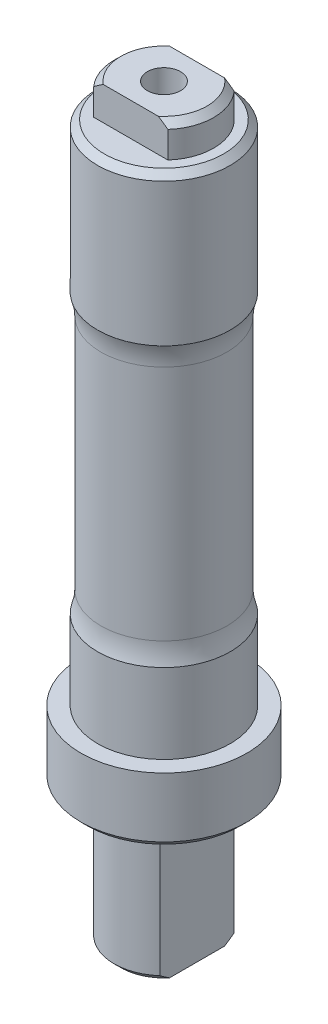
ISO-10303-21;
HEADER;
FILE_DESCRIPTION(('STEP AP214'),'2;1');
FILE_NAME('part.step','',(''),(''),'','','');
FILE_SCHEMA(('AUTOMOTIVE_DESIGN { 1 0 10303 214 1 1 1 1 }'));
ENDSEC;
DATA;
#1=APPLICATION_CONTEXT('core data for automotive mechanical design processes');
#2=APPLICATION_PROTOCOL_DEFINITION('international standard','automotive_design',2000,#1);
#3=PRODUCT_CONTEXT('',#1,'mechanical');
#4=PRODUCT('Part','Part','',(#3));
#5=PRODUCT_RELATED_PRODUCT_CATEGORY('part','',(#4));
#6=PRODUCT_DEFINITION_FORMATION('','',#4);
#7=PRODUCT_DEFINITION_CONTEXT('part definition',#1,'design');
#8=PRODUCT_DEFINITION('design','',#6,#7);
#9=PRODUCT_DEFINITION_SHAPE('','',#8);
#10=(LENGTH_UNIT() NAMED_UNIT(*) SI_UNIT(.MILLI.,.METRE.));
#11=(NAMED_UNIT(*) PLANE_ANGLE_UNIT() SI_UNIT($,.RADIAN.));
#12=(NAMED_UNIT(*) SI_UNIT($,.STERADIAN.) SOLID_ANGLE_UNIT());
#13=UNCERTAINTY_MEASURE_WITH_UNIT(LENGTH_MEASURE(1.E-05),#10,'distance_accuracy_value','');
#14=(GEOMETRIC_REPRESENTATION_CONTEXT(3) GLOBAL_UNCERTAINTY_ASSIGNED_CONTEXT((#13)) GLOBAL_UNIT_ASSIGNED_CONTEXT((#10,
#11,#12)) REPRESENTATION_CONTEXT('',''));
#15=CARTESIAN_POINT('',(0.,0.,0.));
#16=DIRECTION('',(0.,0.,1.));
#17=DIRECTION('',(1.,0.,0.));
#18=AXIS2_PLACEMENT_3D('',#15,#16,#17);
#19=CARTESIAN_POINT('',(0.,38.9818503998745,0.));
#20=DIRECTION('',(0.,1.,0.));
#21=DIRECTION('',(0.,0.,1.));
#22=AXIS2_PLACEMENT_3D('',#19,#20,#21);
#23=CYLINDRICAL_SURFACE('',#22,7.50000000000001);
#24=DIRECTION('',(0.,1.,0.));
#25=VECTOR('',#24,1.);
#26=CARTESIAN_POINT('',(-5.,38.9818503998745,5.59016994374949));
#27=LINE('',#26,#25);
#28=CARTESIAN_POINT('',(-5.,-80.5144266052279,5.59016994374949));
#29=VERTEX_POINT('',#28);
#30=CARTESIAN_POINT('',(-5.,-60.5144266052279,5.59016994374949));
#31=VERTEX_POINT('',#30);
#32=EDGE_CURVE('E164',#29,#31,#27,.T.);
#33=ORIENTED_EDGE('',*,*,#32,.F.);
#34=CARTESIAN_POINT('',(0.,-80.5144266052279,0.));
#35=DIRECTION('',(0.,1.,0.));
#36=DIRECTION('',(0.,0.,1.));
#37=AXIS2_PLACEMENT_3D('',#34,#35,#36);
#38=CIRCLE('',#37,7.50000000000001);
#39=CARTESIAN_POINT('',(5.,-80.5144266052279,5.59016994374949));
#40=VERTEX_POINT('',#39);
#41=EDGE_CURVE('E404',#29,#40,#38,.T.);
#42=ORIENTED_EDGE('',*,*,#41,.T.);
#43=DIRECTION('',(0.,1.,0.));
#44=VECTOR('',#43,1.);
#45=CARTESIAN_POINT('',(5.,38.9818503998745,5.59016994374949));
#46=LINE('',#45,#44);
#47=CARTESIAN_POINT('',(5.,-60.5144266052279,5.59016994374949));
#48=VERTEX_POINT('',#47);
#49=EDGE_CURVE('E156',#48,#40,#46,.F.);
#50=ORIENTED_EDGE('',*,*,#49,.F.);
#51=CARTESIAN_POINT('',(0.,-60.5144266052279,0.));
#52=DIRECTION('',(0.,1.,0.));
#53=DIRECTION('',(0.,0.,1.));
#54=AXIS2_PLACEMENT_3D('',#51,#52,#53);
#55=CIRCLE('',#54,7.50000000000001);
#56=EDGE_CURVE('E185',#31,#48,#55,.T.);
#57=ORIENTED_EDGE('',*,*,#56,.F.);
#58=EDGE_LOOP('',(#33,#42,#50,#57));
#59=FACE_BOUND('',#58,.T.);
#60=ADVANCED_FACE('F36',(#59),#23,.T.);
#61=DIRECTION('',(0.,1.,0.));
#62=VECTOR('',#61,1.);
#63=CARTESIAN_POINT('',(5.,38.9818503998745,-5.59016994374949));
#64=LINE('',#63,#62);
#65=CARTESIAN_POINT('',(5.,-80.5144266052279,-5.59016994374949));
#66=VERTEX_POINT('',#65);
#67=CARTESIAN_POINT('',(5.,-60.5144266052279,-5.59016994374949));
#68=VERTEX_POINT('',#67);
#69=EDGE_CURVE('E159',#66,#68,#64,.T.);
#70=ORIENTED_EDGE('',*,*,#69,.F.);
#71=CARTESIAN_POINT('',(0.,-80.5144266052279,0.));
#72=DIRECTION('',(0.,1.,0.));
#73=DIRECTION('',(0.,0.,1.));
#74=AXIS2_PLACEMENT_3D('',#71,#72,#73);
#75=CIRCLE('',#74,7.50000000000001);
#76=CARTESIAN_POINT('',(-5.,-80.5144266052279,-5.59016994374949));
#77=VERTEX_POINT('',#76);
#78=EDGE_CURVE('E217',#66,#77,#75,.T.);
#79=ORIENTED_EDGE('',*,*,#78,.T.);
#80=DIRECTION('',(0.,1.,0.));
#81=VECTOR('',#80,1.);
#82=CARTESIAN_POINT('',(-5.,38.9818503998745,-5.59016994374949));
#83=LINE('',#82,#81);
#84=CARTESIAN_POINT('',(-5.,-60.5144266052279,-5.59016994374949));
#85=VERTEX_POINT('',#84);
#86=EDGE_CURVE('E161',#85,#77,#83,.F.);
#87=ORIENTED_EDGE('',*,*,#86,.F.);
#88=EDGE_CURVE('E188',#68,#85,#55,.T.);
#89=ORIENTED_EDGE('',*,*,#88,.F.);
#90=EDGE_LOOP('',(#70,#79,#87,#89));
#91=FACE_BOUND('',#90,.T.);
#92=ADVANCED_FACE('F280',(#91),#23,.T.);
#93=CARTESIAN_POINT('',(0.,-81.5144266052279,-7.50000000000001));
#94=DIRECTION('',(0.,1.,0.));
#95=DIRECTION('',(0.,0.,1.));
#96=AXIS2_PLACEMENT_3D('',#93,#94,#95);
#97=PLANE('',#96);
#98=CARTESIAN_POINT('',(0.,-81.5144266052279,0.));
#99=DIRECTION('',(0.,-1.,0.));
#100=DIRECTION('',(0.,0.,-1.));
#101=AXIS2_PLACEMENT_3D('',#98,#99,#100);
#102=CIRCLE('',#101,2.49999999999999);
#103=CARTESIAN_POINT('',(0.,-81.5144266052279,-2.49999999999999));
#104=VERTEX_POINT('',#103);
#105=EDGE_CURVE('E141',#104,#104,#102,.T.);
#106=ORIENTED_EDGE('',*,*,#105,.F.);
#107=EDGE_LOOP('',(#106));
#108=FACE_BOUND('',#107,.T.);
#109=DIRECTION('',(0.,0.,1.));
#110=VECTOR('',#109,1.);
#111=CARTESIAN_POINT('',(-5.,-81.5144266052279,-7.50000000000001));
#112=LINE('',#111,#110);
#113=CARTESIAN_POINT('',(-5.,-81.5144266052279,-4.15331193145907));
#114=VERTEX_POINT('',#113);
#115=CARTESIAN_POINT('',(-5.,-81.5144266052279,4.15331193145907));
#116=VERTEX_POINT('',#115);
#117=EDGE_CURVE('E208',#114,#116,#112,.T.);
#118=ORIENTED_EDGE('',*,*,#117,.F.);
#119=CARTESIAN_POINT('',(0.,-81.5144266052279,0.));
#120=DIRECTION('',(0.,1.,0.));
#121=DIRECTION('',(0.,0.,1.));
#122=AXIS2_PLACEMENT_3D('',#119,#120,#121);
#123=CIRCLE('',#122,6.50000000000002);
#124=CARTESIAN_POINT('',(5.,-81.5144266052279,-4.15331193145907));
#125=VERTEX_POINT('',#124);
#126=EDGE_CURVE('E256',#114,#125,#123,.F.);
#127=ORIENTED_EDGE('',*,*,#126,.T.);
#128=DIRECTION('',(0.,0.,-1.));
#129=VECTOR('',#128,1.);
#130=CARTESIAN_POINT('',(5.,-81.5144266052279,-7.50000000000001));
#131=LINE('',#130,#129);
#132=CARTESIAN_POINT('',(5.,-81.5144266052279,4.15331193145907));
#133=VERTEX_POINT('',#132);
#134=EDGE_CURVE('E205',#133,#125,#131,.T.);
#135=ORIENTED_EDGE('',*,*,#134,.F.);
#136=CARTESIAN_POINT('',(0.,-81.5144266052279,0.));
#137=DIRECTION('',(0.,1.,0.));
#138=DIRECTION('',(0.,0.,1.));
#139=AXIS2_PLACEMENT_3D('',#136,#137,#138);
#140=CIRCLE('',#139,6.50000000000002);
#141=EDGE_CURVE('E418',#133,#116,#140,.F.);
#142=ORIENTED_EDGE('',*,*,#141,.T.);
#143=EDGE_LOOP('',(#118,#127,#135,#142));
#144=FACE_BOUND('',#143,.T.);
#145=ADVANCED_FACE('F286',(#108,#144),#97,.F.);
#146=CARTESIAN_POINT('',(0.,30.9855733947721,0.));
#147=DIRECTION('',(0.,-1.,0.));
#148=DIRECTION('',(0.,0.,-1.));
#149=AXIS2_PLACEMENT_3D('',#146,#147,#148);
#150=PLANE('',#149);
#151=CARTESIAN_POINT('',(0.,30.9855733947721,0.));
#152=DIRECTION('',(0.,1.,0.));
#153=DIRECTION('',(0.,0.,1.));
#154=AXIS2_PLACEMENT_3D('',#151,#152,#153);
#155=CIRCLE('',#154,2.49999999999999);
#156=CARTESIAN_POINT('',(0.,30.9855733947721,2.49999999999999));
#157=VERTEX_POINT('',#156);
#158=EDGE_CURVE('E142',#157,#157,#155,.T.);
#159=ORIENTED_EDGE('',*,*,#158,.F.);
#160=EDGE_LOOP('',(#159));
#161=FACE_BOUND('',#160,.T.);
#162=DIRECTION('',(1.,0.,0.));
#163=VECTOR('',#162,1.);
#164=CARTESIAN_POINT('',(-7.89285647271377,30.9855733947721,5.));
#165=LINE('',#164,#163);
#166=CARTESIAN_POINT('',(-4.15331193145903,30.9855733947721,5.));
#167=VERTEX_POINT('',#166);
#168=CARTESIAN_POINT('',(4.15331193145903,30.9855733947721,5.));
#169=VERTEX_POINT('',#168);
#170=EDGE_CURVE('E170',#167,#169,#165,.T.);
#171=ORIENTED_EDGE('',*,*,#170,.T.);
#172=CARTESIAN_POINT('',(0.,30.9855733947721,0.));
#173=DIRECTION('',(0.,-1.,0.));
#174=DIRECTION('',(0.,0.,-1.));
#175=AXIS2_PLACEMENT_3D('',#172,#173,#174);
#176=CIRCLE('',#175,6.49999999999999);
#177=CARTESIAN_POINT('',(4.15331193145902,30.9855733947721,-5.));
#178=VERTEX_POINT('',#177);
#179=EDGE_CURVE('E352',#169,#178,#176,.F.);
#180=ORIENTED_EDGE('',*,*,#179,.T.);
#181=DIRECTION('',(-1.,0.,0.));
#182=VECTOR('',#181,1.);
#183=CARTESIAN_POINT('',(-7.89285647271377,30.9855733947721,-5.));
#184=LINE('',#183,#182);
#185=CARTESIAN_POINT('',(-4.15331193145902,30.9855733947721,-5.));
#186=VERTEX_POINT('',#185);
#187=EDGE_CURVE('E166',#178,#186,#184,.T.);
#188=ORIENTED_EDGE('',*,*,#187,.T.);
#189=CARTESIAN_POINT('',(0.,30.9855733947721,0.));
#190=DIRECTION('',(0.,-1.,0.));
#191=DIRECTION('',(0.,0.,-1.));
#192=AXIS2_PLACEMENT_3D('',#189,#190,#191);
#193=CIRCLE('',#192,6.49999999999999);
#194=EDGE_CURVE('E394',#186,#167,#193,.F.);
#195=ORIENTED_EDGE('',*,*,#194,.T.);
#196=EDGE_LOOP('',(#171,#180,#188,#195));
#197=FACE_BOUND('',#196,.T.);
#198=ADVANCED_FACE('F325',(#161,#197),#150,.F.);
#199=CARTESIAN_POINT('',(0.,38.9818503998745,0.));
#200=DIRECTION('',(0.,1.,0.));
#201=DIRECTION('',(0.,0.,1.));
#202=AXIS2_PLACEMENT_3D('',#199,#200,#201);
#203=CYLINDRICAL_SURFACE('',#202,7.5);
#204=DIRECTION('',(0.,1.,0.));
#205=VECTOR('',#204,1.);
#206=CARTESIAN_POINT('',(5.59016994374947,38.9818503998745,-5.));
#207=LINE('',#206,#205);
#208=CARTESIAN_POINT('',(5.59016994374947,29.9855733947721,-5.));
#209=VERTEX_POINT('',#208);
#210=CARTESIAN_POINT('',(5.59016994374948,25.9855733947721,-5.));
#211=VERTEX_POINT('',#210);
#212=EDGE_CURVE('E172',#209,#211,#207,.F.);
#213=ORIENTED_EDGE('',*,*,#212,.F.);
#214=CARTESIAN_POINT('',(0.,29.9855733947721,0.));
#215=DIRECTION('',(0.,-1.,0.));
#216=DIRECTION('',(0.,0.,-1.));
#217=AXIS2_PLACEMENT_3D('',#214,#215,#216);
#218=CIRCLE('',#217,7.5);
#219=CARTESIAN_POINT('',(5.59016994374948,29.9855733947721,5.));
#220=VERTEX_POINT('',#219);
#221=EDGE_CURVE('E59',#209,#220,#218,.T.);
#222=ORIENTED_EDGE('',*,*,#221,.T.);
#223=DIRECTION('',(0.,1.,0.));
#224=VECTOR('',#223,1.);
#225=CARTESIAN_POINT('',(5.59016994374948,38.9818503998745,5.));
#226=LINE('',#225,#224);
#227=CARTESIAN_POINT('',(5.59016994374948,25.9855733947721,5.));
#228=VERTEX_POINT('',#227);
#229=EDGE_CURVE('E183',#228,#220,#226,.T.);
#230=ORIENTED_EDGE('',*,*,#229,.F.);
#231=CARTESIAN_POINT('',(0.,25.9855733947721,0.));
#232=DIRECTION('',(0.,1.,0.));
#233=DIRECTION('',(0.,0.,1.));
#234=AXIS2_PLACEMENT_3D('',#231,#232,#233);
#235=CIRCLE('',#234,7.5);
#236=EDGE_CURVE('E202',#228,#211,#235,.T.);
#237=ORIENTED_EDGE('',*,*,#236,.T.);
#238=EDGE_LOOP('',(#213,#222,#230,#237));
#239=FACE_BOUND('',#238,.T.);
#240=ADVANCED_FACE('F322',(#239),#203,.T.);
#241=DIRECTION('',(0.,1.,0.));
#242=VECTOR('',#241,1.);
#243=CARTESIAN_POINT('',(-5.59016994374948,38.9818503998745,5.));
#244=LINE('',#243,#242);
#245=CARTESIAN_POINT('',(-5.59016994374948,29.9855733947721,5.));
#246=VERTEX_POINT('',#245);
#247=CARTESIAN_POINT('',(-5.59016994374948,25.9855733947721,5.));
#248=VERTEX_POINT('',#247);
#249=EDGE_CURVE('E181',#246,#248,#244,.F.);
#250=ORIENTED_EDGE('',*,*,#249,.F.);
#251=CARTESIAN_POINT('',(0.,29.9855733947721,0.));
#252=DIRECTION('',(0.,-1.,0.));
#253=DIRECTION('',(0.,0.,-1.));
#254=AXIS2_PLACEMENT_3D('',#251,#252,#253);
#255=CIRCLE('',#254,7.5);
#256=CARTESIAN_POINT('',(-5.59016994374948,29.9855733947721,-5.));
#257=VERTEX_POINT('',#256);
#258=EDGE_CURVE('E353',#246,#257,#255,.T.);
#259=ORIENTED_EDGE('',*,*,#258,.T.);
#260=DIRECTION('',(0.,1.,0.));
#261=VECTOR('',#260,1.);
#262=CARTESIAN_POINT('',(-5.59016994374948,38.9818503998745,-5.));
#263=LINE('',#262,#261);
#264=CARTESIAN_POINT('',(-5.59016994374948,25.9855733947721,-5.));
#265=VERTEX_POINT('',#264);
#266=EDGE_CURVE('E178',#265,#257,#263,.T.);
#267=ORIENTED_EDGE('',*,*,#266,.F.);
#268=EDGE_CURVE('E201',#265,#248,#235,.T.);
#269=ORIENTED_EDGE('',*,*,#268,.T.);
#270=EDGE_LOOP('',(#250,#259,#267,#269));
#271=FACE_BOUND('',#270,.T.);
#272=ADVANCED_FACE('F320',(#271),#203,.T.);
#273=CARTESIAN_POINT('',(0.,25.9855733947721,-7.5));
#274=DIRECTION('',(0.,-1.,0.));
#275=DIRECTION('',(0.,0.,-1.));
#276=AXIS2_PLACEMENT_3D('',#273,#274,#275);
#277=PLANE('',#276);
#278=CARTESIAN_POINT('',(0.,25.9855733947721,0.));
#279=DIRECTION('',(0.,-1.,0.));
#280=DIRECTION('',(0.,0.,-1.));
#281=AXIS2_PLACEMENT_3D('',#278,#279,#280);
#282=CIRCLE('',#281,8.99999999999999);
#283=CARTESIAN_POINT('',(0.,25.9855733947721,-8.99999999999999));
#284=VERTEX_POINT('',#283);
#285=EDGE_CURVE('E211',#284,#284,#282,.F.);
#286=ORIENTED_EDGE('',*,*,#285,.T.);
#287=EDGE_LOOP('',(#286));
#288=FACE_BOUND('',#287,.T.);
#289=ORIENTED_EDGE('',*,*,#236,.F.);
#290=DIRECTION('',(1.,0.,0.));
#291=VECTOR('',#290,1.);
#292=CARTESIAN_POINT('',(-7.89285647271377,25.9855733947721,5.));
#293=LINE('',#292,#291);
#294=EDGE_CURVE('E169',#248,#228,#293,.T.);
#295=ORIENTED_EDGE('',*,*,#294,.F.);
#296=ORIENTED_EDGE('',*,*,#268,.F.);
#297=DIRECTION('',(-1.,0.,0.));
#298=VECTOR('',#297,1.);
#299=CARTESIAN_POINT('',(-7.89285647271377,25.9855733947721,-5.));
#300=LINE('',#299,#298);
#301=EDGE_CURVE('E167',#211,#265,#300,.T.);
#302=ORIENTED_EDGE('',*,*,#301,.F.);
#303=EDGE_LOOP('',(#289,#295,#296,#302));
#304=FACE_BOUND('',#303,.T.);
#305=ADVANCED_FACE('F316',(#288,#304),#277,.F.);
#306=CARTESIAN_POINT('',(0.,38.9818503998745,0.));
#307=DIRECTION('',(0.,1.,0.));
#308=DIRECTION('',(0.,0.,1.));
#309=AXIS2_PLACEMENT_3D('',#306,#307,#308);
#310=CYLINDRICAL_SURFACE('',#309,10.);
#311=CARTESIAN_POINT('',(0.,24.9855733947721,0.));
#312=DIRECTION('',(0.,-1.,0.));
#313=DIRECTION('',(0.,0.,-1.));
#314=AXIS2_PLACEMENT_3D('',#311,#312,#313);
#315=CIRCLE('',#314,10.);
#316=CARTESIAN_POINT('',(0.,24.9855733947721,-10.));
#317=VERTEX_POINT('',#316);
#318=EDGE_CURVE('E214',#317,#317,#315,.T.);
#319=ORIENTED_EDGE('',*,*,#318,.T.);
#320=EDGE_LOOP('',(#319));
#321=FACE_BOUND('',#320,.T.);
#322=CARTESIAN_POINT('',(0.,3.48557339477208,0.));
#323=DIRECTION('',(0.,1.,0.));
#324=DIRECTION('',(0.,0.,1.));
#325=AXIS2_PLACEMENT_3D('',#322,#323,#324);
#326=CIRCLE('',#325,10.);
#327=CARTESIAN_POINT('',(0.,3.48557339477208,10.));
#328=VERTEX_POINT('',#327);
#329=EDGE_CURVE('E198',#328,#328,#326,.T.);
#330=ORIENTED_EDGE('',*,*,#329,.T.);
#331=EDGE_LOOP('',(#330));
#332=FACE_BOUND('',#331,.T.);
#333=ADVANCED_FACE('F312',(#321,#332),#310,.T.);
#334=CARTESIAN_POINT('',(0.,38.9818503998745,0.));
#335=DIRECTION('',(0.,1.,0.));
#336=DIRECTION('',(0.,0.,1.));
#337=AXIS2_PLACEMENT_3D('',#334,#335,#336);
#338=CYLINDRICAL_SURFACE('',#337,9.5);
#339=CARTESIAN_POINT('',(0.,-35.3919276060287,0.));
#340=DIRECTION('',(0.,-1.,0.));
#341=DIRECTION('',(0.,0.,-1.));
#342=AXIS2_PLACEMENT_3D('',#339,#340,#341);
#343=CIRCLE('',#342,9.5);
#344=CARTESIAN_POINT('',(0.,-35.3919276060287,-9.5));
#345=VERTEX_POINT('',#344);
#346=EDGE_CURVE('E12',#345,#345,#343,.F.);
#347=ORIENTED_EDGE('',*,*,#346,.T.);
#348=EDGE_LOOP('',(#347));
#349=FACE_BOUND('',#348,.T.);
#350=CARTESIAN_POINT('',(0.,0.363074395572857,0.));
#351=DIRECTION('',(0.,1.,0.));
#352=DIRECTION('',(0.,0.,1.));
#353=AXIS2_PLACEMENT_3D('',#350,#351,#352);
#354=CIRCLE('',#353,9.5);
#355=CARTESIAN_POINT('',(0.,0.363074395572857,9.5));
#356=VERTEX_POINT('',#355);
#357=EDGE_CURVE('E44',#356,#356,#354,.F.);
#358=ORIENTED_EDGE('',*,*,#357,.T.);
#359=EDGE_LOOP('',(#358));
#360=FACE_BOUND('',#359,.T.);
#361=ADVANCED_FACE('F308',(#349,#360),#338,.T.);
#362=CARTESIAN_POINT('',(0.,38.9818503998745,0.));
#363=DIRECTION('',(0.,1.,0.));
#364=DIRECTION('',(0.,0.,1.));
#365=AXIS2_PLACEMENT_3D('',#362,#363,#364);
#366=CYLINDRICAL_SURFACE('',#365,10.);
#367=CARTESIAN_POINT('',(0.,-38.5144266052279,0.));
#368=DIRECTION('',(0.,1.,0.));
#369=DIRECTION('',(0.,0.,1.));
#370=AXIS2_PLACEMENT_3D('',#367,#368,#369);
#371=CIRCLE('',#370,10.);
#372=CARTESIAN_POINT('',(0.,-38.5144266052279,10.));
#373=VERTEX_POINT('',#372);
#374=EDGE_CURVE('E195',#373,#373,#371,.T.);
#375=ORIENTED_EDGE('',*,*,#374,.F.);
#376=EDGE_LOOP('',(#375));
#377=FACE_BOUND('',#376,.T.);
#378=CARTESIAN_POINT('',(0.,-50.5144266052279,0.));
#379=DIRECTION('',(0.,1.,0.));
#380=DIRECTION('',(0.,0.,1.));
#381=AXIS2_PLACEMENT_3D('',#378,#379,#380);
#382=CIRCLE('',#381,10.);
#383=CARTESIAN_POINT('',(0.,-50.5144266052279,10.));
#384=VERTEX_POINT('',#383);
#385=EDGE_CURVE('E192',#384,#384,#382,.T.);
#386=ORIENTED_EDGE('',*,*,#385,.T.);
#387=EDGE_LOOP('',(#386));
#388=FACE_BOUND('',#387,.T.);
#389=ADVANCED_FACE('F304',(#377,#388),#366,.T.);
#390=CARTESIAN_POINT('',(0.,-50.5144266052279,-10.));
#391=DIRECTION('',(0.,-1.,0.));
#392=DIRECTION('',(0.,0.,-1.));
#393=AXIS2_PLACEMENT_3D('',#390,#391,#392);
#394=PLANE('',#393);
#395=ORIENTED_EDGE('',*,*,#385,.F.);
#396=EDGE_LOOP('',(#395));
#397=FACE_BOUND('',#396,.T.);
#398=CARTESIAN_POINT('',(0.,-50.5144266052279,0.));
#399=DIRECTION('',(0.,1.,0.));
#400=DIRECTION('',(0.,0.,1.));
#401=AXIS2_PLACEMENT_3D('',#398,#399,#400);
#402=CIRCLE('',#401,12.5);
#403=CARTESIAN_POINT('',(0.,-50.5144266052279,12.5));
#404=VERTEX_POINT('',#403);
#405=EDGE_CURVE('E189',#404,#404,#402,.T.);
#406=ORIENTED_EDGE('',*,*,#405,.T.);
#407=EDGE_LOOP('',(#406));
#408=FACE_BOUND('',#407,.T.);
#409=ADVANCED_FACE('F300',(#397,#408),#394,.F.);
#410=CARTESIAN_POINT('',(0.,38.9818503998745,0.));
#411=DIRECTION('',(0.,1.,0.));
#412=DIRECTION('',(0.,0.,1.));
#413=AXIS2_PLACEMENT_3D('',#410,#411,#412);
#414=CYLINDRICAL_SURFACE('',#413,12.5);
#415=CARTESIAN_POINT('',(0.,-59.5144266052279,0.));
#416=DIRECTION('',(0.,1.,0.));
#417=DIRECTION('',(0.,0.,1.));
#418=AXIS2_PLACEMENT_3D('',#415,#416,#417);
#419=CIRCLE('',#418,12.5);
#420=CARTESIAN_POINT('',(0.,-59.5144266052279,12.5));
#421=VERTEX_POINT('',#420);
#422=EDGE_CURVE('E400',#421,#421,#419,.T.);
#423=ORIENTED_EDGE('',*,*,#422,.T.);
#424=EDGE_LOOP('',(#423));
#425=FACE_BOUND('',#424,.T.);
#426=ORIENTED_EDGE('',*,*,#405,.F.);
#427=EDGE_LOOP('',(#426));
#428=FACE_BOUND('',#427,.T.);
#429=ADVANCED_FACE('F296',(#425,#428),#414,.T.);
#430=CARTESIAN_POINT('',(0.,-60.5144266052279,-12.5));
#431=DIRECTION('',(0.,1.,0.));
#432=DIRECTION('',(0.,0.,1.));
#433=AXIS2_PLACEMENT_3D('',#430,#431,#432);
#434=PLANE('',#433);
#435=CARTESIAN_POINT('',(0.,-60.5144266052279,0.));
#436=DIRECTION('',(0.,1.,0.));
#437=DIRECTION('',(0.,0.,1.));
#438=AXIS2_PLACEMENT_3D('',#435,#436,#437);
#439=CIRCLE('',#438,11.5);
#440=CARTESIAN_POINT('',(0.,-60.5144266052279,11.5));
#441=VERTEX_POINT('',#440);
#442=EDGE_CURVE('E397',#441,#441,#439,.F.);
#443=ORIENTED_EDGE('',*,*,#442,.T.);
#444=EDGE_LOOP('',(#443));
#445=FACE_BOUND('',#444,.T.);
#446=ORIENTED_EDGE('',*,*,#88,.T.);
#447=DIRECTION('',(0.,0.,-1.));
#448=VECTOR('',#447,1.);
#449=CARTESIAN_POINT('',(-5.,-60.5144266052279,-7.84463128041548));
#450=LINE('',#449,#448);
#451=EDGE_CURVE('E152',#31,#85,#450,.T.);
#452=ORIENTED_EDGE('',*,*,#451,.F.);
#453=ORIENTED_EDGE('',*,*,#56,.T.);
#454=DIRECTION('',(0.,0.,1.));
#455=VECTOR('',#454,1.);
#456=CARTESIAN_POINT('',(5.,-60.5144266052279,-7.84463128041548));
#457=LINE('',#456,#455);
#458=EDGE_CURVE('E154',#68,#48,#457,.T.);
#459=ORIENTED_EDGE('',*,*,#458,.F.);
#460=EDGE_LOOP('',(#446,#452,#453,#459));
#461=FACE_BOUND('',#460,.T.);
#462=ADVANCED_FACE('F292',(#445,#461),#434,.F.);
#463=CARTESIAN_POINT('',(-7.89285647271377,25.9855733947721,-5.));
#464=DIRECTION('',(0.,0.,-1.));
#465=DIRECTION('',(-1.,0.,0.));
#466=AXIS2_PLACEMENT_3D('',#463,#464,#465);
#467=PLANE('',#466);
#468=ORIENTED_EDGE('',*,*,#187,.F.);
#469=CARTESIAN_POINT('',(4.15331193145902,30.9855733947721,-5.));
#470=CARTESIAN_POINT('',(4.2762895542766,30.9069776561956,-5.));
#471=CARTESIAN_POINT('',(4.39833700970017,30.8269445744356,-5.));
#472=CARTESIAN_POINT('',(4.64072592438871,30.664415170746,-5.));
#473=CARTESIAN_POINT('',(4.76106791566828,30.5819196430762,-5.));
#474=CARTESIAN_POINT('',(5.00027029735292,30.4148318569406,-5.));
#475=CARTESIAN_POINT('',(5.11913078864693,30.3302397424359,-5.));
#476=CARTESIAN_POINT('',(5.35557663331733,30.1592118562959,-5.));
#477=CARTESIAN_POINT('',(5.47316156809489,30.072775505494,-5.));
#478=CARTESIAN_POINT('',(5.59016994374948,29.9855733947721,-5.));
#479=B_SPLINE_CURVE_WITH_KNOTS('',3,(#469,#470,#471,#472,#473,#474,#475,#476,#477,#478),
.UNSPECIFIED.,.F.,.F.,(4,2,2,2,4),(0.,0.43781964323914,0.87549956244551,1.31314951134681,
1.75093898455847),.UNSPECIFIED.);
#480=EDGE_CURVE('E372',#178,#209,#479,.T.);
#481=ORIENTED_EDGE('',*,*,#480,.T.);
#482=ORIENTED_EDGE('',*,*,#212,.T.);
#483=ORIENTED_EDGE('',*,*,#301,.T.);
#484=ORIENTED_EDGE('',*,*,#266,.T.);
#485=CARTESIAN_POINT('',(-5.59016994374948,29.9855733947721,-5.));
#486=CARTESIAN_POINT('',(-5.47316156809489,30.072775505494,-5.));
#487=CARTESIAN_POINT('',(-5.35557663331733,30.1592118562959,-5.));
#488=CARTESIAN_POINT('',(-5.11913078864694,30.3302397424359,-5.));
#489=CARTESIAN_POINT('',(-5.00027029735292,30.4148318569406,-5.));
#490=CARTESIAN_POINT('',(-4.76106791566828,30.5819196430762,-5.));
#491=CARTESIAN_POINT('',(-4.64072592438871,30.664415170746,-5.));
#492=CARTESIAN_POINT('',(-4.39833700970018,30.8269445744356,-5.));
#493=CARTESIAN_POINT('',(-4.2762895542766,30.9069776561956,-5.));
#494=CARTESIAN_POINT('',(-4.15331193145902,30.9855733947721,-5.));
#495=B_SPLINE_CURVE_WITH_KNOTS('',3,(#485,#486,#487,#488,#489,#490,#491,#492,#493,#494),
.UNSPECIFIED.,.F.,.F.,(4,2,2,2,4),(0.,0.437789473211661,0.875439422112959,1.31311934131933,
1.75093898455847),.UNSPECIFIED.);
#496=EDGE_CURVE('E377',#257,#186,#495,.T.);
#497=ORIENTED_EDGE('',*,*,#496,.T.);
#498=EDGE_LOOP('',(#468,#481,#482,#483,#484,#497));
#499=FACE_BOUND('',#498,.T.);
#500=ADVANCED_FACE('F295',(#499),#467,.T.);
#501=CARTESIAN_POINT('',(-7.89285647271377,25.9855733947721,5.));
#502=DIRECTION('',(0.,0.,1.));
#503=DIRECTION('',(1.,0.,0.));
#504=AXIS2_PLACEMENT_3D('',#501,#502,#503);
#505=PLANE('',#504);
#506=ORIENTED_EDGE('',*,*,#229,.T.);
#507=CARTESIAN_POINT('',(5.59016994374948,29.9855733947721,5.));
#508=CARTESIAN_POINT('',(5.47316156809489,30.072775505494,5.));
#509=CARTESIAN_POINT('',(5.35557663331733,30.1592118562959,5.));
#510=CARTESIAN_POINT('',(5.11913078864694,30.3302397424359,5.));
#511=CARTESIAN_POINT('',(5.00027029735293,30.4148318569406,5.));
#512=CARTESIAN_POINT('',(4.76106791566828,30.5819196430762,5.));
#513=CARTESIAN_POINT('',(4.64072592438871,30.664415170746,5.));
#514=CARTESIAN_POINT('',(4.39833700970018,30.8269445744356,5.));
#515=CARTESIAN_POINT('',(4.2762895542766,30.9069776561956,5.));
#516=CARTESIAN_POINT('',(4.15331193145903,30.9855733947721,5.));
#517=B_SPLINE_CURVE_WITH_KNOTS('',3,(#507,#508,#509,#510,#511,#512,#513,#514,#515,#516),
.UNSPECIFIED.,.F.,.F.,(4,2,2,2,4),(0.,0.437789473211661,0.875439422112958,1.31311934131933,
1.75093898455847),.UNSPECIFIED.);
#518=EDGE_CURVE('E347',#220,#169,#517,.T.);
#519=ORIENTED_EDGE('',*,*,#518,.T.);
#520=ORIENTED_EDGE('',*,*,#170,.F.);
#521=CARTESIAN_POINT('',(-4.15331193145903,30.9855733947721,5.));
#522=CARTESIAN_POINT('',(-4.2762895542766,30.9069776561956,5.));
#523=CARTESIAN_POINT('',(-4.39833700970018,30.8269445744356,5.));
#524=CARTESIAN_POINT('',(-4.64072592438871,30.664415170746,5.));
#525=CARTESIAN_POINT('',(-4.76106791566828,30.5819196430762,5.));
#526=CARTESIAN_POINT('',(-5.00027029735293,30.4148318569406,5.));
#527=CARTESIAN_POINT('',(-5.11913078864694,30.3302397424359,5.));
#528=CARTESIAN_POINT('',(-5.35557663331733,30.1592118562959,5.));
#529=CARTESIAN_POINT('',(-5.47316156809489,30.072775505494,5.));
#530=CARTESIAN_POINT('',(-5.59016994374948,29.9855733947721,5.));
#531=B_SPLINE_CURVE_WITH_KNOTS('',3,(#521,#522,#523,#524,#525,#526,#527,#528,#529,#530),
.UNSPECIFIED.,.F.,.F.,(4,2,2,2,4),(0.,0.43781964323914,0.87549956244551,1.31314951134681,
1.75093898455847),.UNSPECIFIED.);
#532=EDGE_CURVE('E51',#167,#246,#531,.T.);
#533=ORIENTED_EDGE('',*,*,#532,.T.);
#534=ORIENTED_EDGE('',*,*,#249,.T.);
#535=ORIENTED_EDGE('',*,*,#294,.T.);
#536=EDGE_LOOP('',(#506,#519,#520,#533,#534,#535));
#537=FACE_BOUND('',#536,.T.);
#538=ADVANCED_FACE('F265',(#537),#505,.T.);
#539=CARTESIAN_POINT('',(5.,-60.5144266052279,-7.84463128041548));
#540=DIRECTION('',(1.,0.,0.));
#541=DIRECTION('',(0.,0.,-1.));
#542=AXIS2_PLACEMENT_3D('',#539,#540,#541);
#543=PLANE('',#542);
#544=ORIENTED_EDGE('',*,*,#134,.T.);
#545=CARTESIAN_POINT('',(5.,-81.5144266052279,-4.15331193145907));
#546=CARTESIAN_POINT('',(5.,-81.4358308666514,-4.27628955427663));
#547=CARTESIAN_POINT('',(5.,-81.3557977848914,-4.39833700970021));
#548=CARTESIAN_POINT('',(5.,-81.1932683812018,-4.64072592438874));
#549=CARTESIAN_POINT('',(5.,-81.1107728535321,-4.76106791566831));
#550=CARTESIAN_POINT('',(5.,-80.9436850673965,-5.00027029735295));
#551=CARTESIAN_POINT('',(5.,-80.8590929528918,-5.11913078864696));
#552=CARTESIAN_POINT('',(5.,-80.6880650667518,-5.35557663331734));
#553=CARTESIAN_POINT('',(5.,-80.6016287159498,-5.4731615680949));
#554=CARTESIAN_POINT('',(5.,-80.5144266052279,-5.59016994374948));
#555=B_SPLINE_CURVE_WITH_KNOTS('',3,(#545,#546,#547,#548,#549,#550,#551,#552,#553,#554),
.UNSPECIFIED.,.F.,.F.,(4,2,2,2,4),(0.,0.437819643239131,0.875499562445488,1.31314951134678,
1.75093898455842),.UNSPECIFIED.);
#556=EDGE_CURVE('E255',#125,#66,#555,.T.);
#557=ORIENTED_EDGE('',*,*,#556,.T.);
#558=ORIENTED_EDGE('',*,*,#69,.T.);
#559=ORIENTED_EDGE('',*,*,#458,.T.);
#560=ORIENTED_EDGE('',*,*,#49,.T.);
#561=CARTESIAN_POINT('',(5.,-80.5144266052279,5.59016994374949));
#562=CARTESIAN_POINT('',(5.,-80.6016287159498,5.4731615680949));
#563=CARTESIAN_POINT('',(5.,-80.6880650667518,5.35557663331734));
#564=CARTESIAN_POINT('',(5.,-80.8590929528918,5.11913078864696));
#565=CARTESIAN_POINT('',(5.,-80.9436850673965,5.00027029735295));
#566=CARTESIAN_POINT('',(5.,-81.1107728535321,4.76106791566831));
#567=CARTESIAN_POINT('',(5.,-81.1932683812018,4.64072592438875));
#568=CARTESIAN_POINT('',(5.,-81.3557977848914,4.39833700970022));
#569=CARTESIAN_POINT('',(5.,-81.4358308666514,4.27628955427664));
#570=CARTESIAN_POINT('',(5.,-81.5144266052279,4.15331193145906));
#571=B_SPLINE_CURVE_WITH_KNOTS('',3,(#561,#562,#563,#564,#565,#566,#567,#568,#569,#570),
.UNSPECIFIED.,.F.,.F.,(4,2,2,2,4),(0.,0.437789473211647,0.875439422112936,1.31311934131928,
1.75093898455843),.UNSPECIFIED.);
#572=EDGE_CURVE('E249',#40,#133,#571,.T.);
#573=ORIENTED_EDGE('',*,*,#572,.T.);
#574=EDGE_LOOP('',(#544,#557,#558,#559,#560,#573));
#575=FACE_BOUND('',#574,.T.);
#576=ADVANCED_FACE('F261',(#575),#543,.T.);
#577=CARTESIAN_POINT('',(-5.,-60.5144266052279,-7.84463128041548));
#578=DIRECTION('',(-1.,0.,0.));
#579=DIRECTION('',(0.,0.,1.));
#580=AXIS2_PLACEMENT_3D('',#577,#578,#579);
#581=PLANE('',#580);
#582=ORIENTED_EDGE('',*,*,#86,.T.);
#583=CARTESIAN_POINT('',(-5.,-80.5144266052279,-5.59016994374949));
#584=CARTESIAN_POINT('',(-5.,-80.6016287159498,-5.4731615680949));
#585=CARTESIAN_POINT('',(-5.,-80.6880650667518,-5.35557663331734));
#586=CARTESIAN_POINT('',(-5.,-80.8590929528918,-5.11913078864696));
#587=CARTESIAN_POINT('',(-5.,-80.9436850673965,-5.00027029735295));
#588=CARTESIAN_POINT('',(-5.,-81.1107728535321,-4.76106791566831));
#589=CARTESIAN_POINT('',(-5.,-81.1932683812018,-4.64072592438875));
#590=CARTESIAN_POINT('',(-5.,-81.3557977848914,-4.39833700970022));
#591=CARTESIAN_POINT('',(-5.,-81.4358308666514,-4.27628955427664));
#592=CARTESIAN_POINT('',(-5.,-81.5144266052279,-4.15331193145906));
#593=B_SPLINE_CURVE_WITH_KNOTS('',3,(#583,#584,#585,#586,#587,#588,#589,#590,#591,#592),
.UNSPECIFIED.,.F.,.F.,(4,2,2,2,4),(0.,0.437789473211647,0.875439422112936,1.31311934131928,
1.75093898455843),.UNSPECIFIED.);
#594=EDGE_CURVE('E227',#77,#114,#593,.T.);
#595=ORIENTED_EDGE('',*,*,#594,.T.);
#596=ORIENTED_EDGE('',*,*,#117,.T.);
#597=CARTESIAN_POINT('',(-5.,-81.5144266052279,4.15331193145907));
#598=CARTESIAN_POINT('',(-5.,-81.4358308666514,4.27628955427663));
#599=CARTESIAN_POINT('',(-5.,-81.3557977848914,4.39833700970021));
#600=CARTESIAN_POINT('',(-5.,-81.1932683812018,4.64072592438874));
#601=CARTESIAN_POINT('',(-5.,-81.1107728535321,4.76106791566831));
#602=CARTESIAN_POINT('',(-5.,-80.9436850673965,5.00027029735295));
#603=CARTESIAN_POINT('',(-5.,-80.8590929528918,5.11913078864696));
#604=CARTESIAN_POINT('',(-5.,-80.6880650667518,5.35557663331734));
#605=CARTESIAN_POINT('',(-5.,-80.6016287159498,5.4731615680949));
#606=CARTESIAN_POINT('',(-5.,-80.5144266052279,5.59016994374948));
#607=B_SPLINE_CURVE_WITH_KNOTS('',3,(#597,#598,#599,#600,#601,#602,#603,#604,#605,#606),
.UNSPECIFIED.,.F.,.F.,(4,2,2,2,4),(0.,0.437819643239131,0.875499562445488,1.31314951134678,
1.75093898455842),.UNSPECIFIED.);
#608=EDGE_CURVE('E220',#116,#29,#607,.T.);
#609=ORIENTED_EDGE('',*,*,#608,.T.);
#610=ORIENTED_EDGE('',*,*,#32,.T.);
#611=ORIENTED_EDGE('',*,*,#451,.T.);
#612=EDGE_LOOP('',(#582,#595,#596,#609,#610,#611));
#613=FACE_BOUND('',#612,.T.);
#614=ADVANCED_FACE('F233',(#613),#581,.T.);
#615=CARTESIAN_POINT('',(0.,25.9855733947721,0.));
#616=DIRECTION('',(0.,-1.,0.));
#617=DIRECTION('',(0.,0.,-1.));
#618=AXIS2_PLACEMENT_3D('',#615,#616,#617);
#619=CONICAL_SURFACE('',#618,8.99999999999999,0.785398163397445);
#620=ORIENTED_EDGE('',*,*,#318,.F.);
#621=EDGE_LOOP('',(#620));
#622=FACE_BOUND('',#621,.T.);
#623=ORIENTED_EDGE('',*,*,#285,.F.);
#624=EDGE_LOOP('',(#623));
#625=FACE_BOUND('',#624,.T.);
#626=ADVANCED_FACE('F328',(#622,#625),#619,.T.);
#627=CARTESIAN_POINT('',(0.,-80.5144266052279,0.));
#628=DIRECTION('',(0.,1.,0.));
#629=DIRECTION('',(0.,0.,1.));
#630=AXIS2_PLACEMENT_3D('',#627,#628,#629);
#631=CONICAL_SURFACE('',#630,7.50000000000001,0.78539816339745);
#632=ORIENTED_EDGE('',*,*,#556,.F.);
#633=ORIENTED_EDGE('',*,*,#126,.F.);
#634=ORIENTED_EDGE('',*,*,#594,.F.);
#635=ORIENTED_EDGE('',*,*,#78,.F.);
#636=EDGE_LOOP('',(#632,#633,#634,#635));
#637=FACE_BOUND('',#636,.T.);
#638=ADVANCED_FACE('F242',(#637),#631,.T.);
#639=CARTESIAN_POINT('',(0.,-80.5144266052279,0.));
#640=DIRECTION('',(0.,1.,0.));
#641=DIRECTION('',(0.,0.,1.));
#642=AXIS2_PLACEMENT_3D('',#639,#640,#641);
#643=CONICAL_SURFACE('',#642,7.50000000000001,0.78539816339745);
#644=ORIENTED_EDGE('',*,*,#608,.F.);
#645=ORIENTED_EDGE('',*,*,#141,.F.);
#646=ORIENTED_EDGE('',*,*,#572,.F.);
#647=ORIENTED_EDGE('',*,*,#41,.F.);
#648=EDGE_LOOP('',(#644,#645,#646,#647));
#649=FACE_BOUND('',#648,.T.);
#650=ADVANCED_FACE('F237',(#649),#643,.T.);
#651=CARTESIAN_POINT('',(0.,-59.5144266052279,0.));
#652=DIRECTION('',(0.,1.,0.));
#653=DIRECTION('',(0.,0.,1.));
#654=AXIS2_PLACEMENT_3D('',#651,#652,#653);
#655=CONICAL_SURFACE('',#654,12.5,0.785398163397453);
#656=ORIENTED_EDGE('',*,*,#442,.F.);
#657=EDGE_LOOP('',(#656));
#658=FACE_BOUND('',#657,.T.);
#659=ORIENTED_EDGE('',*,*,#422,.F.);
#660=EDGE_LOOP('',(#659));
#661=FACE_BOUND('',#660,.T.);
#662=ADVANCED_FACE('F241',(#658,#661),#655,.T.);
#663=CARTESIAN_POINT('',(0.,30.9855733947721,0.));
#664=DIRECTION('',(0.,-1.,0.));
#665=DIRECTION('',(0.,0.,-1.));
#666=AXIS2_PLACEMENT_3D('',#663,#664,#665);
#667=CONICAL_SURFACE('',#666,6.49999999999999,0.785398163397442);
#668=ORIENTED_EDGE('',*,*,#518,.F.);
#669=ORIENTED_EDGE('',*,*,#221,.F.);
#670=ORIENTED_EDGE('',*,*,#480,.F.);
#671=ORIENTED_EDGE('',*,*,#179,.F.);
#672=EDGE_LOOP('',(#668,#669,#670,#671));
#673=FACE_BOUND('',#672,.T.);
#674=ADVANCED_FACE('F350',(#673),#667,.T.);
#675=CARTESIAN_POINT('',(0.,30.9855733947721,0.));
#676=DIRECTION('',(0.,-1.,0.));
#677=DIRECTION('',(0.,0.,-1.));
#678=AXIS2_PLACEMENT_3D('',#675,#676,#677);
#679=CONICAL_SURFACE('',#678,6.49999999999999,0.785398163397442);
#680=ORIENTED_EDGE('',*,*,#496,.F.);
#681=ORIENTED_EDGE('',*,*,#258,.F.);
#682=ORIENTED_EDGE('',*,*,#532,.F.);
#683=ORIENTED_EDGE('',*,*,#194,.F.);
#684=EDGE_LOOP('',(#680,#681,#682,#683));
#685=FACE_BOUND('',#684,.T.);
#686=ADVANCED_FACE('F368',(#685),#679,.T.);
#687=CARTESIAN_POINT('',(0.,0.36307439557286,0.));
#688=DIRECTION('',(0.,1.,0.));
#689=DIRECTION('',(0.,0.,1.));
#690=AXIS2_PLACEMENT_3D('',#687,#688,#689);
#691=TOROIDAL_SURFACE('',#690,19.5,10.);
#692=ORIENTED_EDGE('',*,*,#357,.F.);
#693=EDGE_LOOP('',(#692));
#694=FACE_BOUND('',#693,.T.);
#695=ORIENTED_EDGE('',*,*,#329,.F.);
#696=EDGE_LOOP('',(#695));
#697=FACE_BOUND('',#696,.T.);
#698=ADVANCED_FACE('F537',(#694,#697),#691,.F.);
#699=CARTESIAN_POINT('',(0.,-35.3919276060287,0.));
#700=DIRECTION('',(0.,-1.,0.));
#701=DIRECTION('',(0.,0.,-1.));
#702=AXIS2_PLACEMENT_3D('',#699,#700,#701);
#703=TOROIDAL_SURFACE('',#702,19.5,10.);
#704=ORIENTED_EDGE('',*,*,#374,.T.);
#705=EDGE_LOOP('',(#704));
#706=FACE_BOUND('',#705,.T.);
#707=ORIENTED_EDGE('',*,*,#346,.F.);
#708=EDGE_LOOP('',(#707));
#709=FACE_BOUND('',#708,.T.);
#710=ADVANCED_FACE('F38',(#706,#709),#703,.F.);
#711=CARTESIAN_POINT('',(0.,-61.5144266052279,0.));
#712=DIRECTION('',(0.,-1.,0.));
#713=DIRECTION('',(0.,0.,-1.));
#714=AXIS2_PLACEMENT_3D('',#711,#712,#713);
#715=CONICAL_SURFACE('',#714,2.49999999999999,1.02974425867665);
#716=CARTESIAN_POINT('',(0.,-60.012275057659,0.));
#717=VERTEX_POINT('',#716);
#718=VERTEX_LOOP('',#717);
#719=FACE_BOUND('',#718,.T.);
#720=CARTESIAN_POINT('',(0.,-61.5144266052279,0.));
#721=DIRECTION('',(0.,-1.,0.));
#722=DIRECTION('',(0.,0.,-1.));
#723=AXIS2_PLACEMENT_3D('',#720,#721,#722);
#724=CIRCLE('',#723,2.49999999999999);
#725=CARTESIAN_POINT('',(0.,-61.5144266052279,-2.49999999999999));
#726=VERTEX_POINT('',#725);
#727=EDGE_CURVE('E145',#726,#726,#724,.T.);
#728=ORIENTED_EDGE('',*,*,#727,.T.);
#729=EDGE_LOOP('',(#728));
#730=FACE_BOUND('',#729,.T.);
#731=ADVANCED_FACE('F267',(#719,#730),#715,.F.);
#732=CARTESIAN_POINT('',(0.,-81.5144266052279,0.));
#733=DIRECTION('',(0.,-1.,0.));
#734=DIRECTION('',(0.,0.,-1.));
#735=AXIS2_PLACEMENT_3D('',#732,#733,#734);
#736=CYLINDRICAL_SURFACE('',#735,2.49999999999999);
#737=ORIENTED_EDGE('',*,*,#727,.F.);
#738=EDGE_LOOP('',(#737));
#739=FACE_BOUND('',#738,.T.);
#740=ORIENTED_EDGE('',*,*,#105,.T.);
#741=EDGE_LOOP('',(#740));
#742=FACE_BOUND('',#741,.T.);
#743=ADVANCED_FACE('F135',(#739,#742),#736,.F.);
#744=CARTESIAN_POINT('',(0.,10.9855733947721,0.));
#745=DIRECTION('',(0.,1.,0.));
#746=DIRECTION('',(0.,0.,1.));
#747=AXIS2_PLACEMENT_3D('',#744,#745,#746);
#748=CONICAL_SURFACE('',#747,2.49999999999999,1.02974425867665);
#749=CARTESIAN_POINT('',(0.,9.48342184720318,0.));
#750=VERTEX_POINT('',#749);
#751=VERTEX_LOOP('',#750);
#752=FACE_BOUND('',#751,.T.);
#753=CARTESIAN_POINT('',(0.,10.9855733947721,0.));
#754=DIRECTION('',(0.,1.,0.));
#755=DIRECTION('',(0.,0.,1.));
#756=AXIS2_PLACEMENT_3D('',#753,#754,#755);
#757=CIRCLE('',#756,2.49999999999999);
#758=CARTESIAN_POINT('',(0.,10.9855733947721,2.49999999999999));
#759=VERTEX_POINT('',#758);
#760=EDGE_CURVE('E139',#759,#759,#757,.T.);
#761=ORIENTED_EDGE('',*,*,#760,.T.);
#762=EDGE_LOOP('',(#761));
#763=FACE_BOUND('',#762,.T.);
#764=ADVANCED_FACE('F131',(#752,#763),#748,.F.);
#765=CARTESIAN_POINT('',(0.,30.9855733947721,0.));
#766=DIRECTION('',(0.,1.,0.));
#767=DIRECTION('',(0.,0.,1.));
#768=AXIS2_PLACEMENT_3D('',#765,#766,#767);
#769=CYLINDRICAL_SURFACE('',#768,2.49999999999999);
#770=ORIENTED_EDGE('',*,*,#760,.F.);
#771=EDGE_LOOP('',(#770));
#772=FACE_BOUND('',#771,.T.);
#773=ORIENTED_EDGE('',*,*,#158,.T.);
#774=EDGE_LOOP('',(#773));
#775=FACE_BOUND('',#774,.T.);
#776=ADVANCED_FACE('F134',(#772,#775),#769,.F.);
#777=CLOSED_SHELL('',(#60,#92,#145,#198,#240,#272,#305,#333,#361,#389,#409,#429,#462,#500,#538,
#576,#614,#626,#638,#650,#662,#674,#686,#698,#710,#731,#743,#764,#776));
#778=MANIFOLD_SOLID_BREP('B2',#777);
#779=ADVANCED_BREP_SHAPE_REPRESENTATION('',(#18,#778),#14);
#780=SHAPE_DEFINITION_REPRESENTATION(#9,#779);
ENDSEC;
END-ISO-10303-21;
